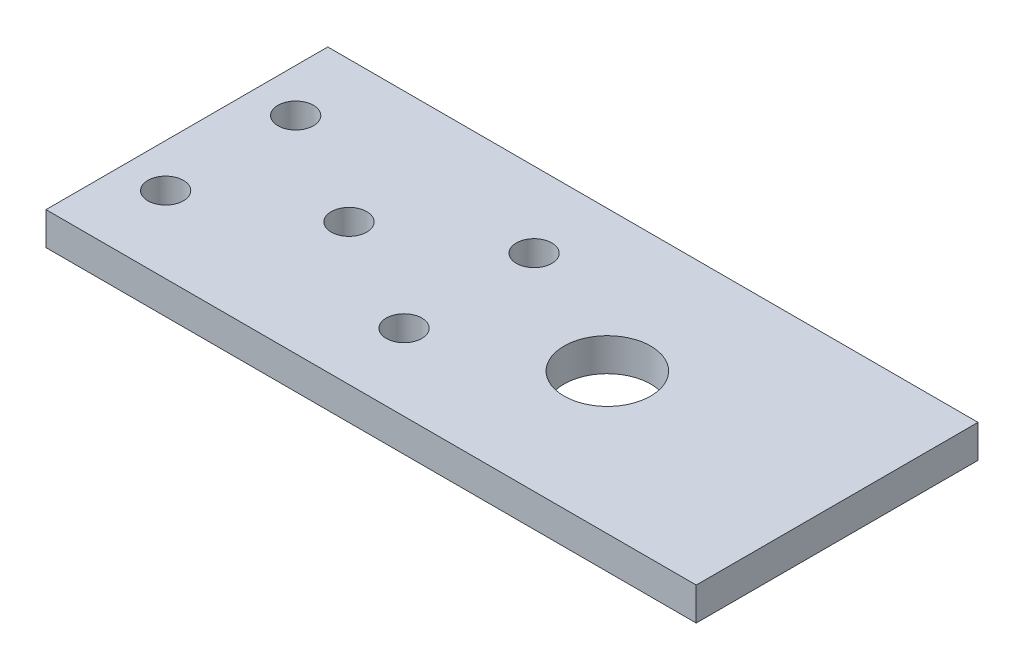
from build123d import *

# Parameters (mm, degrees)
SKETCH1_W      = 190.5
SKETCH1_H      = 82.55
SKETCH1_R      = 5.207
SKETCH1_R_2    = 12.7
EXTRUDE1_DEPTH = 9.652


with BuildPart() as part:
    # Sketch1 → Extrude1 (new body)
    with BuildSketch(Plane(origin=(0, 0, 0), x_dir=(1, 0, 0), z_dir=(0, 1, 0))):
        with Locations((95.25, 41.275)):
            Rectangle(SKETCH1_W, SKETCH1_H)
        with Locations(Location((47.498, 41.275, 0), (0, 0, 270))):
            Circle(SKETCH1_R, mode=Mode.SUBTRACT)
        with Locations(Location((123.19, 41.275, 0), (0, 0, 270))):
            Circle(SKETCH1_R_2, mode=Mode.SUBTRACT)
        with Locations(Location((12.7, 60.452, 0), (0, 0, 270))):
            Circle(SKETCH1_R, mode=Mode.SUBTRACT)
        with Locations(Location((12.7, 22.352, 0), (0, 0, 270))):
            Circle(SKETCH1_R, mode=Mode.SUBTRACT)
        with Locations(Location((82.55, 22.352, 0), (0, 0, 270))):
            Circle(SKETCH1_R, mode=Mode.SUBTRACT)
        with Locations(Location((82.55, 60.452, 0), (0, 0, 270))):
            Circle(SKETCH1_R, mode=Mode.SUBTRACT)
    extrude(amount=EXTRUDE1_DEPTH)


solid = part.part
